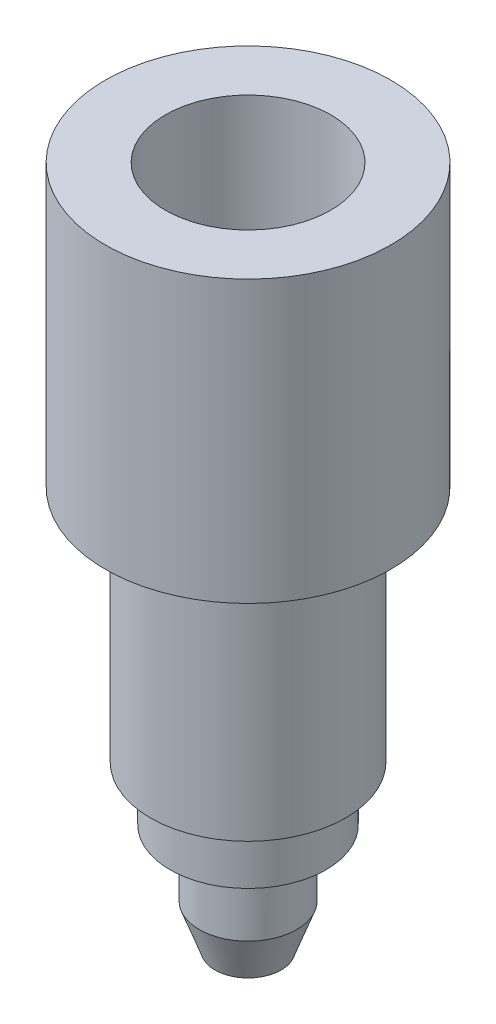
ISO-10303-21;
HEADER;
FILE_DESCRIPTION(('STEP AP214'),'2;1');
FILE_NAME('part.step','',(''),(''),'','','');
FILE_SCHEMA(('AUTOMOTIVE_DESIGN { 1 0 10303 214 1 1 1 1 }'));
ENDSEC;
DATA;
#1=APPLICATION_CONTEXT('core data for automotive mechanical design processes');
#2=APPLICATION_PROTOCOL_DEFINITION('international standard','automotive_design',2000,#1);
#3=PRODUCT_CONTEXT('',#1,'mechanical');
#4=PRODUCT('Part','Part','',(#3));
#5=PRODUCT_RELATED_PRODUCT_CATEGORY('part','',(#4));
#6=PRODUCT_DEFINITION_FORMATION('','',#4);
#7=PRODUCT_DEFINITION_CONTEXT('part definition',#1,'design');
#8=PRODUCT_DEFINITION('design','',#6,#7);
#9=PRODUCT_DEFINITION_SHAPE('','',#8);
#10=(LENGTH_UNIT() NAMED_UNIT(*) SI_UNIT(.MILLI.,.METRE.));
#11=(NAMED_UNIT(*) PLANE_ANGLE_UNIT() SI_UNIT($,.RADIAN.));
#12=(NAMED_UNIT(*) SI_UNIT($,.STERADIAN.) SOLID_ANGLE_UNIT());
#13=UNCERTAINTY_MEASURE_WITH_UNIT(LENGTH_MEASURE(1.E-05),#10,'distance_accuracy_value','');
#14=(GEOMETRIC_REPRESENTATION_CONTEXT(3) GLOBAL_UNCERTAINTY_ASSIGNED_CONTEXT((#13)) GLOBAL_UNIT_ASSIGNED_CONTEXT((#10,
#11,#12)) REPRESENTATION_CONTEXT('',''));
#15=CARTESIAN_POINT('',(0.,0.,0.));
#16=DIRECTION('',(0.,0.,1.));
#17=DIRECTION('',(1.,0.,0.));
#18=AXIS2_PLACEMENT_3D('',#15,#16,#17);
#19=CARTESIAN_POINT('',(0.,0.,0.));
#20=DIRECTION('',(0.,1.,0.));
#21=DIRECTION('',(0.,0.,1.));
#22=AXIS2_PLACEMENT_3D('',#19,#20,#21);
#23=PLANE('',#22);
#24=CARTESIAN_POINT('',(0.,0.,0.));
#25=DIRECTION('',(0.,-1.,0.));
#26=DIRECTION('',(0.,0.,-1.));
#27=AXIS2_PLACEMENT_3D('',#24,#25,#26);
#28=CIRCLE('',#27,1.0795);
#29=CARTESIAN_POINT('',(0.,0.,-1.0795));
#30=VERTEX_POINT('',#29);
#31=EDGE_CURVE('E44',#30,#30,#28,.T.);
#32=ORIENTED_EDGE('',*,*,#31,.T.);
#33=EDGE_LOOP('',(#32));
#34=FACE_BOUND('',#33,.T.);
#35=ADVANCED_FACE('F33',(#34),#23,.F.);
#36=CARTESIAN_POINT('',(0.,1.39571852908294,0.));
#37=DIRECTION('',(0.,1.,0.));
#38=DIRECTION('',(0.,0.,1.));
#39=AXIS2_PLACEMENT_3D('',#36,#37,#38);
#40=CONICAL_SURFACE('',#39,1.5875,0.349065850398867);
#41=ORIENTED_EDGE('',*,*,#31,.F.);
#42=EDGE_LOOP('',(#41));
#43=FACE_BOUND('',#42,.T.);
#44=CARTESIAN_POINT('',(0.,1.39571852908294,0.));
#45=DIRECTION('',(0.,-1.,0.));
#46=DIRECTION('',(0.,0.,-1.));
#47=AXIS2_PLACEMENT_3D('',#44,#45,#46);
#48=CIRCLE('',#47,1.5875);
#49=CARTESIAN_POINT('',(0.,1.39571852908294,-1.5875));
#50=VERTEX_POINT('',#49);
#51=EDGE_CURVE('E48',#50,#50,#48,.T.);
#52=ORIENTED_EDGE('',*,*,#51,.T.);
#53=EDGE_LOOP('',(#52));
#54=FACE_BOUND('',#53,.T.);
#55=ADVANCED_FACE('F98',(#43,#54),#40,.T.);
#56=CARTESIAN_POINT('',(0.,0.,0.));
#57=DIRECTION('',(0.,-1.,0.));
#58=DIRECTION('',(0.,0.,-1.));
#59=AXIS2_PLACEMENT_3D('',#56,#57,#58);
#60=CYLINDRICAL_SURFACE('',#59,1.5875);
#61=CARTESIAN_POINT('',(0.,3.048,0.));
#62=DIRECTION('',(0.,1.,0.));
#63=DIRECTION('',(0.,0.,1.));
#64=AXIS2_PLACEMENT_3D('',#61,#62,#63);
#65=CIRCLE('',#64,1.5875);
#66=CARTESIAN_POINT('',(0.,3.048,1.5875));
#67=VERTEX_POINT('',#66);
#68=EDGE_CURVE('E40',#67,#67,#65,.F.);
#69=ORIENTED_EDGE('',*,*,#68,.T.);
#70=EDGE_LOOP('',(#69));
#71=FACE_BOUND('',#70,.T.);
#72=ORIENTED_EDGE('',*,*,#51,.F.);
#73=EDGE_LOOP('',(#72));
#74=FACE_BOUND('',#73,.T.);
#75=ADVANCED_FACE('F103',(#71,#74),#60,.T.);
#76=CARTESIAN_POINT('',(-1.5875,3.556,0.));
#77=DIRECTION('',(0.,1.,0.));
#78=DIRECTION('',(0.,0.,1.));
#79=AXIS2_PLACEMENT_3D('',#76,#77,#78);
#80=PLANE('',#79);
#81=CARTESIAN_POINT('',(0.,3.556,0.));
#82=DIRECTION('',(0.,1.,0.));
#83=DIRECTION('',(0.,0.,1.));
#84=AXIS2_PLACEMENT_3D('',#81,#82,#83);
#85=CIRCLE('',#84,2.0955);
#86=CARTESIAN_POINT('',(0.,3.556,2.0955));
#87=VERTEX_POINT('',#86);
#88=EDGE_CURVE('E10',#87,#87,#85,.T.);
#89=ORIENTED_EDGE('',*,*,#88,.T.);
#90=EDGE_LOOP('',(#89));
#91=FACE_BOUND('',#90,.T.);
#92=CARTESIAN_POINT('',(0.,3.556,0.));
#93=DIRECTION('',(0.,-1.,0.));
#94=DIRECTION('',(0.,0.,-1.));
#95=AXIS2_PLACEMENT_3D('',#92,#93,#94);
#96=CIRCLE('',#95,2.54);
#97=CARTESIAN_POINT('',(0.,3.556,-2.54));
#98=VERTEX_POINT('',#97);
#99=EDGE_CURVE('E53',#98,#98,#96,.T.);
#100=ORIENTED_EDGE('',*,*,#99,.T.);
#101=EDGE_LOOP('',(#100));
#102=FACE_BOUND('',#101,.T.);
#103=ADVANCED_FACE('F109',(#91,#102),#80,.F.);
#104=CARTESIAN_POINT('',(0.,0.,0.));
#105=DIRECTION('',(0.,-1.,0.));
#106=DIRECTION('',(0.,0.,-1.));
#107=AXIS2_PLACEMENT_3D('',#104,#105,#106);
#108=CYLINDRICAL_SURFACE('',#107,2.54);
#109=ORIENTED_EDGE('',*,*,#99,.F.);
#110=EDGE_LOOP('',(#109));
#111=FACE_BOUND('',#110,.T.);
#112=CARTESIAN_POINT('',(0.,5.334,0.));
#113=DIRECTION('',(0.,-1.,0.));
#114=DIRECTION('',(0.,0.,-1.));
#115=AXIS2_PLACEMENT_3D('',#112,#113,#114);
#116=CIRCLE('',#115,2.54);
#117=CARTESIAN_POINT('',(0.,5.334,-2.54));
#118=VERTEX_POINT('',#117);
#119=EDGE_CURVE('E56',#118,#118,#116,.T.);
#120=ORIENTED_EDGE('',*,*,#119,.T.);
#121=EDGE_LOOP('',(#120));
#122=FACE_BOUND('',#121,.T.);
#123=ADVANCED_FACE('F112',(#111,#122),#108,.T.);
#124=CARTESIAN_POINT('',(-2.54,5.334,0.));
#125=DIRECTION('',(0.,1.,0.));
#126=DIRECTION('',(0.,0.,1.));
#127=AXIS2_PLACEMENT_3D('',#124,#125,#126);
#128=PLANE('',#127);
#129=ORIENTED_EDGE('',*,*,#119,.F.);
#130=EDGE_LOOP('',(#129));
#131=FACE_BOUND('',#130,.T.);
#132=CARTESIAN_POINT('',(0.,5.334,0.));
#133=DIRECTION('',(0.,-1.,0.));
#134=DIRECTION('',(0.,0.,-1.));
#135=AXIS2_PLACEMENT_3D('',#132,#133,#134);
#136=CIRCLE('',#135,3.175);
#137=CARTESIAN_POINT('',(0.,5.334,-3.175));
#138=VERTEX_POINT('',#137);
#139=EDGE_CURVE('E59',#138,#138,#136,.T.);
#140=ORIENTED_EDGE('',*,*,#139,.T.);
#141=EDGE_LOOP('',(#140));
#142=FACE_BOUND('',#141,.T.);
#143=ADVANCED_FACE('F115',(#131,#142),#128,.F.);
#144=CARTESIAN_POINT('',(0.,0.,0.));
#145=DIRECTION('',(0.,-1.,0.));
#146=DIRECTION('',(0.,0.,-1.));
#147=AXIS2_PLACEMENT_3D('',#144,#145,#146);
#148=CYLINDRICAL_SURFACE('',#147,3.175);
#149=ORIENTED_EDGE('',*,*,#139,.F.);
#150=EDGE_LOOP('',(#149));
#151=FACE_BOUND('',#150,.T.);
#152=CARTESIAN_POINT('',(0.,12.319,0.));
#153=DIRECTION('',(0.,-1.,0.));
#154=DIRECTION('',(0.,0.,-1.));
#155=AXIS2_PLACEMENT_3D('',#152,#153,#154);
#156=CIRCLE('',#155,3.175);
#157=CARTESIAN_POINT('',(0.,12.319,-3.175));
#158=VERTEX_POINT('',#157);
#159=EDGE_CURVE('E62',#158,#158,#156,.T.);
#160=ORIENTED_EDGE('',*,*,#159,.T.);
#161=EDGE_LOOP('',(#160));
#162=FACE_BOUND('',#161,.T.);
#163=ADVANCED_FACE('F119',(#151,#162),#148,.T.);
#164=CARTESIAN_POINT('',(0.,13.081,0.));
#165=DIRECTION('',(0.,1.,0.));
#166=DIRECTION('',(0.,0.,1.));
#167=AXIS2_PLACEMENT_3D('',#164,#165,#166);
#168=CONICAL_SURFACE('',#167,3.937,0.785398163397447);
#169=ORIENTED_EDGE('',*,*,#159,.F.);
#170=EDGE_LOOP('',(#169));
#171=FACE_BOUND('',#170,.T.);
#172=CARTESIAN_POINT('',(0.,13.081,0.));
#173=DIRECTION('',(0.,-1.,0.));
#174=DIRECTION('',(0.,0.,-1.));
#175=AXIS2_PLACEMENT_3D('',#172,#173,#174);
#176=CIRCLE('',#175,3.937);
#177=CARTESIAN_POINT('',(0.,13.081,-3.937));
#178=VERTEX_POINT('',#177);
#179=EDGE_CURVE('E65',#178,#178,#176,.T.);
#180=ORIENTED_EDGE('',*,*,#179,.T.);
#181=EDGE_LOOP('',(#180));
#182=FACE_BOUND('',#181,.T.);
#183=ADVANCED_FACE('F123',(#171,#182),#168,.T.);
#184=CARTESIAN_POINT('',(-3.937,13.081,0.));
#185=DIRECTION('',(0.,1.,0.));
#186=DIRECTION('',(0.,0.,1.));
#187=AXIS2_PLACEMENT_3D('',#184,#185,#186);
#188=PLANE('',#187);
#189=ORIENTED_EDGE('',*,*,#179,.F.);
#190=EDGE_LOOP('',(#189));
#191=FACE_BOUND('',#190,.T.);
#192=CARTESIAN_POINT('',(0.,13.081,0.));
#193=DIRECTION('',(0.,-1.,0.));
#194=DIRECTION('',(0.,0.,-1.));
#195=AXIS2_PLACEMENT_3D('',#192,#193,#194);
#196=CIRCLE('',#195,4.6482);
#197=CARTESIAN_POINT('',(0.,13.081,-4.6482));
#198=VERTEX_POINT('',#197);
#199=EDGE_CURVE('E68',#198,#198,#196,.T.);
#200=ORIENTED_EDGE('',*,*,#199,.T.);
#201=EDGE_LOOP('',(#200));
#202=FACE_BOUND('',#201,.T.);
#203=ADVANCED_FACE('F127',(#191,#202),#188,.F.);
#204=CARTESIAN_POINT('',(0.,0.,0.));
#205=DIRECTION('',(0.,-1.,0.));
#206=DIRECTION('',(0.,0.,-1.));
#207=AXIS2_PLACEMENT_3D('',#204,#205,#206);
#208=CYLINDRICAL_SURFACE('',#207,4.6482);
#209=ORIENTED_EDGE('',*,*,#199,.F.);
#210=EDGE_LOOP('',(#209));
#211=FACE_BOUND('',#210,.T.);
#212=CARTESIAN_POINT('',(0.,22.225,0.));
#213=DIRECTION('',(0.,-1.,0.));
#214=DIRECTION('',(0.,0.,-1.));
#215=AXIS2_PLACEMENT_3D('',#212,#213,#214);
#216=CIRCLE('',#215,4.6482);
#217=CARTESIAN_POINT('',(0.,22.225,-4.6482));
#218=VERTEX_POINT('',#217);
#219=EDGE_CURVE('E71',#218,#218,#216,.T.);
#220=ORIENTED_EDGE('',*,*,#219,.T.);
#221=EDGE_LOOP('',(#220));
#222=FACE_BOUND('',#221,.T.);
#223=ADVANCED_FACE('F131',(#211,#222),#208,.T.);
#224=CARTESIAN_POINT('',(-4.6482,22.225,0.));
#225=DIRECTION('',(0.,-1.,0.));
#226=DIRECTION('',(0.,0.,-1.));
#227=AXIS2_PLACEMENT_3D('',#224,#225,#226);
#228=PLANE('',#227);
#229=ORIENTED_EDGE('',*,*,#219,.F.);
#230=EDGE_LOOP('',(#229));
#231=FACE_BOUND('',#230,.T.);
#232=CARTESIAN_POINT('',(0.,22.225,0.));
#233=DIRECTION('',(0.,-1.,0.));
#234=DIRECTION('',(0.,0.,-1.));
#235=AXIS2_PLACEMENT_3D('',#232,#233,#234);
#236=CIRCLE('',#235,2.6924);
#237=CARTESIAN_POINT('',(0.,22.225,-2.6924));
#238=VERTEX_POINT('',#237);
#239=EDGE_CURVE('E74',#238,#238,#236,.T.);
#240=ORIENTED_EDGE('',*,*,#239,.T.);
#241=EDGE_LOOP('',(#240));
#242=FACE_BOUND('',#241,.T.);
#243=ADVANCED_FACE('F135',(#231,#242),#228,.F.);
#244=CARTESIAN_POINT('',(0.,0.,0.));
#245=DIRECTION('',(0.,-1.,0.));
#246=DIRECTION('',(0.,0.,-1.));
#247=AXIS2_PLACEMENT_3D('',#244,#245,#246);
#248=CYLINDRICAL_SURFACE('',#247,2.6924);
#249=ORIENTED_EDGE('',*,*,#239,.F.);
#250=EDGE_LOOP('',(#249));
#251=FACE_BOUND('',#250,.T.);
#252=CARTESIAN_POINT('',(0.,15.2146,0.));
#253=DIRECTION('',(0.,-1.,0.));
#254=DIRECTION('',(0.,0.,-1.));
#255=AXIS2_PLACEMENT_3D('',#252,#253,#254);
#256=CIRCLE('',#255,2.6924);
#257=CARTESIAN_POINT('',(0.,15.2146,-2.6924));
#258=VERTEX_POINT('',#257);
#259=EDGE_CURVE('E77',#258,#258,#256,.T.);
#260=ORIENTED_EDGE('',*,*,#259,.T.);
#261=EDGE_LOOP('',(#260));
#262=FACE_BOUND('',#261,.T.);
#263=ADVANCED_FACE('F94',(#251,#262),#248,.F.);
#264=CARTESIAN_POINT('',(0.,12.6746,0.));
#265=DIRECTION('',(0.,1.,0.));
#266=DIRECTION('',(0.,0.,1.));
#267=AXIS2_PLACEMENT_3D('',#264,#265,#266);
#268=CONICAL_SURFACE('',#267,1.27,0.510488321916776);
#269=ORIENTED_EDGE('',*,*,#259,.F.);
#270=EDGE_LOOP('',(#269));
#271=FACE_BOUND('',#270,.T.);
#272=CARTESIAN_POINT('',(0.,12.6746,0.));
#273=DIRECTION('',(0.,-1.,0.));
#274=DIRECTION('',(0.,0.,-1.));
#275=AXIS2_PLACEMENT_3D('',#272,#273,#274);
#276=CIRCLE('',#275,1.27);
#277=CARTESIAN_POINT('',(0.,12.6746,-1.27));
#278=VERTEX_POINT('',#277);
#279=EDGE_CURVE('E80',#278,#278,#276,.T.);
#280=ORIENTED_EDGE('',*,*,#279,.T.);
#281=EDGE_LOOP('',(#280));
#282=FACE_BOUND('',#281,.T.);
#283=ADVANCED_FACE('F84',(#271,#282),#268,.F.);
#284=CARTESIAN_POINT('',(-1.27,12.6746,0.));
#285=DIRECTION('',(0.,-1.,0.));
#286=DIRECTION('',(0.,0.,-1.));
#287=AXIS2_PLACEMENT_3D('',#284,#285,#286);
#288=PLANE('',#287);
#289=ORIENTED_EDGE('',*,*,#279,.F.);
#290=EDGE_LOOP('',(#289));
#291=FACE_BOUND('',#290,.T.);
#292=ADVANCED_FACE('F86',(#291),#288,.F.);
#293=CARTESIAN_POINT('',(0.,3.048,0.));
#294=DIRECTION('',(0.,1.,0.));
#295=DIRECTION('',(0.,0.,1.));
#296=AXIS2_PLACEMENT_3D('',#293,#294,#295);
#297=TOROIDAL_SURFACE('',#296,2.0955,0.508);
#298=ORIENTED_EDGE('',*,*,#88,.F.);
#299=EDGE_LOOP('',(#298));
#300=FACE_BOUND('',#299,.T.);
#301=ORIENTED_EDGE('',*,*,#68,.F.);
#302=EDGE_LOOP('',(#301));
#303=FACE_BOUND('',#302,.T.);
#304=ADVANCED_FACE('F35',(#300,#303),#297,.F.);
#305=CLOSED_SHELL('',(#35,#55,#75,#103,#123,#143,#163,#183,#203,#223,#243,#263,#283,#292,#304));
#306=MANIFOLD_SOLID_BREP('B2',#305);
#307=ADVANCED_BREP_SHAPE_REPRESENTATION('',(#18,#306),#14);
#308=SHAPE_DEFINITION_REPRESENTATION(#9,#307);
ENDSEC;
END-ISO-10303-21;
